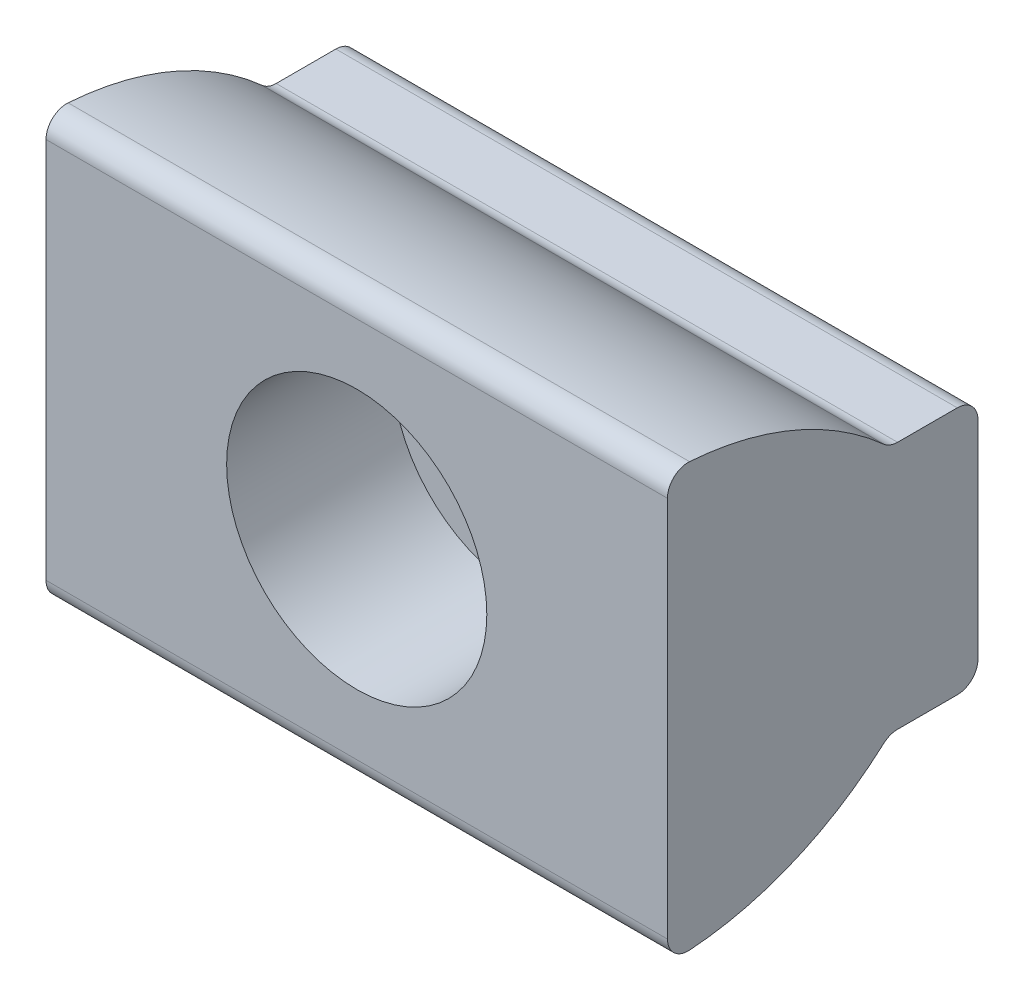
ISO-10303-21;
HEADER;
FILE_DESCRIPTION(('STEP AP214'),'2;1');
FILE_NAME('part.step','',(''),(''),'','','');
FILE_SCHEMA(('AUTOMOTIVE_DESIGN { 1 0 10303 214 1 1 1 1 }'));
ENDSEC;
DATA;
#1=APPLICATION_CONTEXT('core data for automotive mechanical design processes');
#2=APPLICATION_PROTOCOL_DEFINITION('international standard','automotive_design',2000,#1);
#3=PRODUCT_CONTEXT('',#1,'mechanical');
#4=PRODUCT('Part','Part','',(#3));
#5=PRODUCT_RELATED_PRODUCT_CATEGORY('part','',(#4));
#6=PRODUCT_DEFINITION_FORMATION('','',#4);
#7=PRODUCT_DEFINITION_CONTEXT('part definition',#1,'design');
#8=PRODUCT_DEFINITION('design','',#6,#7);
#9=PRODUCT_DEFINITION_SHAPE('','',#8);
#10=(LENGTH_UNIT() NAMED_UNIT(*) SI_UNIT(.MILLI.,.METRE.));
#11=(NAMED_UNIT(*) PLANE_ANGLE_UNIT() SI_UNIT($,.RADIAN.));
#12=(NAMED_UNIT(*) SI_UNIT($,.STERADIAN.) SOLID_ANGLE_UNIT());
#13=UNCERTAINTY_MEASURE_WITH_UNIT(LENGTH_MEASURE(1.E-05),#10,'distance_accuracy_value','');
#14=(GEOMETRIC_REPRESENTATION_CONTEXT(3) GLOBAL_UNCERTAINTY_ASSIGNED_CONTEXT((#13)) GLOBAL_UNIT_ASSIGNED_CONTEXT((#10,
#11,#12)) REPRESENTATION_CONTEXT('',''));
#15=CARTESIAN_POINT('',(0.,0.,0.));
#16=DIRECTION('',(0.,0.,1.));
#17=DIRECTION('',(1.,0.,0.));
#18=AXIS2_PLACEMENT_3D('',#15,#16,#17);
#19=CARTESIAN_POINT('',(23.8125,-7.9375,0.));
#20=DIRECTION('',(0.,0.,1.));
#21=DIRECTION('',(1.,0.,0.));
#22=AXIS2_PLACEMENT_3D('',#19,#20,#21);
#23=PLANE('',#22);
#24=DIRECTION('',(0.,1.,0.));
#25=VECTOR('',#24,1.);
#26=CARTESIAN_POINT('',(-23.8125,-7.9375,0.));
#27=LINE('',#26,#25);
#28=CARTESIAN_POINT('',(-23.8125,-7.9375,0.));
#29=VERTEX_POINT('',#28);
#30=CARTESIAN_POINT('',(-23.8125,7.9375,0.));
#31=VERTEX_POINT('',#30);
#32=EDGE_CURVE('E135',#29,#31,#27,.T.);
#33=ORIENTED_EDGE('',*,*,#32,.T.);
#34=DIRECTION('',(-1.,0.,0.));
#35=VECTOR('',#34,1.);
#36=CARTESIAN_POINT('',(23.8125,7.9375,0.));
#37=LINE('',#36,#35);
#38=CARTESIAN_POINT('',(23.8125,7.9375,0.));
#39=VERTEX_POINT('',#38);
#40=EDGE_CURVE('E186',#39,#31,#37,.T.);
#41=ORIENTED_EDGE('',*,*,#40,.F.);
#42=DIRECTION('',(0.,1.,0.));
#43=VECTOR('',#42,1.);
#44=CARTESIAN_POINT('',(23.8125,-7.9375,0.));
#45=LINE('',#44,#43);
#46=CARTESIAN_POINT('',(23.8125,-7.9375,0.));
#47=VERTEX_POINT('',#46);
#48=EDGE_CURVE('E158',#47,#39,#45,.T.);
#49=ORIENTED_EDGE('',*,*,#48,.F.);
#50=DIRECTION('',(-1.,0.,0.));
#51=VECTOR('',#50,1.);
#52=CARTESIAN_POINT('',(23.8125,-7.9375,0.));
#53=LINE('',#52,#51);
#54=EDGE_CURVE('E189',#47,#29,#53,.T.);
#55=ORIENTED_EDGE('',*,*,#54,.T.);
#56=EDGE_LOOP('',(#33,#41,#49,#55));
#57=FACE_BOUND('',#56,.T.);
#58=CARTESIAN_POINT('',(0.,0.,0.));
#59=DIRECTION('',(0.,0.,1.));
#60=DIRECTION('',(1.,0.,0.));
#61=AXIS2_PLACEMENT_3D('',#58,#59,#60);
#62=CIRCLE('',#61,6.7437);
#63=CARTESIAN_POINT('',(6.7437,0.,0.));
#64=VERTEX_POINT('',#63);
#65=EDGE_CURVE('E18',#64,#64,#62,.F.);
#66=ORIENTED_EDGE('',*,*,#65,.F.);
#67=EDGE_LOOP('',(#66));
#68=FACE_BOUND('',#67,.T.);
#69=ADVANCED_FACE('F14',(#57,#68),#23,.F.);
#70=CARTESIAN_POINT('',(23.8125,-14.6269565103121,23.7998));
#71=DIRECTION('',(0.,0.,-1.));
#72=DIRECTION('',(-1.,0.,0.));
#73=AXIS2_PLACEMENT_3D('',#70,#71,#72);
#74=PLANE('',#73);
#75=DIRECTION('',(0.,-1.,0.));
#76=VECTOR('',#75,1.);
#77=CARTESIAN_POINT('',(-23.8125,-14.6269565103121,23.7998));
#78=LINE('',#77,#76);
#79=CARTESIAN_POINT('',(-23.8125,14.6269565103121,23.7998));
#80=VERTEX_POINT('',#79);
#81=CARTESIAN_POINT('',(-23.8125,-14.6269565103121,23.7998));
#82=VERTEX_POINT('',#81);
#83=EDGE_CURVE('E147',#80,#82,#78,.T.);
#84=ORIENTED_EDGE('',*,*,#83,.T.);
#85=DIRECTION('',(-1.,0.,0.));
#86=VECTOR('',#85,1.);
#87=CARTESIAN_POINT('',(23.8125,-14.6269565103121,23.7998));
#88=LINE('',#87,#86);
#89=CARTESIAN_POINT('',(23.8125,-14.6269565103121,23.7998));
#90=VERTEX_POINT('',#89);
#91=EDGE_CURVE('E122',#90,#82,#88,.T.);
#92=ORIENTED_EDGE('',*,*,#91,.F.);
#93=DIRECTION('',(0.,-1.,0.));
#94=VECTOR('',#93,1.);
#95=CARTESIAN_POINT('',(23.8125,-14.6269565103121,23.7998));
#96=LINE('',#95,#94);
#97=CARTESIAN_POINT('',(23.8125,14.6269565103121,23.7998));
#98=VERTEX_POINT('',#97);
#99=EDGE_CURVE('E31',#98,#90,#96,.T.);
#100=ORIENTED_EDGE('',*,*,#99,.F.);
#101=DIRECTION('',(-1.,0.,0.));
#102=VECTOR('',#101,1.);
#103=CARTESIAN_POINT('',(23.8125,14.6269565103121,23.7998));
#104=LINE('',#103,#102);
#105=EDGE_CURVE('E171',#98,#80,#104,.T.);
#106=ORIENTED_EDGE('',*,*,#105,.T.);
#107=EDGE_LOOP('',(#84,#92,#100,#106));
#108=FACE_BOUND('',#107,.T.);
#109=CARTESIAN_POINT('',(0.,0.,23.7998));
#110=DIRECTION('',(0.,0.,-1.));
#111=DIRECTION('',(-1.,0.,0.));
#112=AXIS2_PLACEMENT_3D('',#109,#110,#111);
#113=CIRCLE('',#112,9.9695);
#114=CARTESIAN_POINT('',(-9.9695,0.,23.7998));
#115=VERTEX_POINT('',#114);
#116=EDGE_CURVE('E125',#115,#115,#113,.F.);
#117=ORIENTED_EDGE('',*,*,#116,.F.);
#118=EDGE_LOOP('',(#117));
#119=FACE_BOUND('',#118,.T.);
#120=ADVANCED_FACE('F224',(#108,#119),#74,.F.);
#121=CARTESIAN_POINT('',(23.8125,-14.6269565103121,22.2123));
#122=DIRECTION('',(-1.,0.,0.));
#123=DIRECTION('',(0.,-1.,0.));
#124=AXIS2_PLACEMENT_3D('',#121,#122,#123);
#125=CYLINDRICAL_SURFACE('',#124,1.5875);
#126=CARTESIAN_POINT('',(-23.8125,-14.6269565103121,22.2123));
#127=DIRECTION('',(1.,0.,0.));
#128=DIRECTION('',(0.,-1.,0.));
#129=AXIS2_PLACEMENT_3D('',#126,#127,#128);
#130=CIRCLE('',#129,1.5875);
#131=CARTESIAN_POINT('',(-23.8125,-16.21075392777,22.1039395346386));
#132=VERTEX_POINT('',#131);
#133=EDGE_CURVE('E109',#82,#132,#130,.T.);
#134=ORIENTED_EDGE('',*,*,#133,.T.);
#135=DIRECTION('',(-1.,0.,0.));
#136=VECTOR('',#135,1.);
#137=CARTESIAN_POINT('',(23.8125,-16.21075392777,22.1039395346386));
#138=LINE('',#137,#136);
#139=CARTESIAN_POINT('',(23.8125,-16.21075392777,22.1039395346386));
#140=VERTEX_POINT('',#139);
#141=EDGE_CURVE('E9',#140,#132,#138,.T.);
#142=ORIENTED_EDGE('',*,*,#141,.F.);
#143=CARTESIAN_POINT('',(23.8125,-14.6269565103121,22.2123));
#144=DIRECTION('',(1.,0.,0.));
#145=DIRECTION('',(0.,-1.,0.));
#146=AXIS2_PLACEMENT_3D('',#143,#144,#145);
#147=CIRCLE('',#146,1.5875);
#148=EDGE_CURVE('E149',#90,#140,#147,.T.);
#149=ORIENTED_EDGE('',*,*,#148,.F.);
#150=ORIENTED_EDGE('',*,*,#91,.T.);
#151=EDGE_LOOP('',(#134,#142,#149,#150));
#152=FACE_BOUND('',#151,.T.);
#153=ADVANCED_FACE('F16',(#152),#125,.T.);
#154=CARTESIAN_POINT('',(23.8125,8.57595602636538,23.7998));
#155=DIRECTION('',(-1.,0.,0.));
#156=DIRECTION('',(0.,-1.,0.));
#157=AXIS2_PLACEMENT_3D('',#154,#155,#156);
#158=CYLINDRICAL_SURFACE('',#157,24.8446560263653);
#159=CARTESIAN_POINT('',(-23.8125,8.57595602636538,23.7998));
#160=DIRECTION('',(1.,0.,0.));
#161=DIRECTION('',(0.,1.,0.));
#162=AXIS2_PLACEMENT_3D('',#159,#160,#161);
#163=CIRCLE('',#162,24.8446560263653);
#164=CARTESIAN_POINT('',(-23.8125,-9.93002272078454,7.22313918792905));
#165=VERTEX_POINT('',#164);
#166=EDGE_CURVE('E105',#132,#165,#163,.T.);
#167=ORIENTED_EDGE('',*,*,#166,.T.);
#168=DIRECTION('',(-1.,0.,0.));
#169=VECTOR('',#168,1.);
#170=CARTESIAN_POINT('',(23.8125,-9.93002272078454,7.22313918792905));
#171=LINE('',#170,#169);
#172=CARTESIAN_POINT('',(23.8125,-9.93002272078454,7.22313918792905));
#173=VERTEX_POINT('',#172);
#174=EDGE_CURVE('E23',#173,#165,#171,.T.);
#175=ORIENTED_EDGE('',*,*,#174,.F.);
#176=CARTESIAN_POINT('',(23.8125,8.57595602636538,23.7998));
#177=DIRECTION('',(1.,0.,0.));
#178=DIRECTION('',(0.,1.,0.));
#179=AXIS2_PLACEMENT_3D('',#176,#177,#178);
#180=CIRCLE('',#179,24.8446560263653);
#181=EDGE_CURVE('E118',#140,#173,#180,.T.);
#182=ORIENTED_EDGE('',*,*,#181,.F.);
#183=ORIENTED_EDGE('',*,*,#141,.T.);
#184=EDGE_LOOP('',(#167,#175,#182,#183));
#185=FACE_BOUND('',#184,.T.);
#186=ADVANCED_FACE('F117',(#185),#158,.T.);
#187=CARTESIAN_POINT('',(23.8125,-11.1125,6.16393961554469));
#188=DIRECTION('',(-1.,0.,0.));
#189=DIRECTION('',(0.,-1.,0.));
#190=AXIS2_PLACEMENT_3D('',#187,#188,#189);
#191=CYLINDRICAL_SURFACE('',#190,1.5875);
#192=CARTESIAN_POINT('',(-23.8125,-11.1125,6.16393961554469));
#193=DIRECTION('',(-1.,0.,0.));
#194=DIRECTION('',(0.,-1.,0.));
#195=AXIS2_PLACEMENT_3D('',#192,#193,#194);
#196=CIRCLE('',#195,1.5875);
#197=CARTESIAN_POINT('',(-23.8125,-9.525,6.16393961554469));
#198=VERTEX_POINT('',#197);
#199=EDGE_CURVE('E111',#165,#198,#196,.T.);
#200=ORIENTED_EDGE('',*,*,#199,.T.);
#201=DIRECTION('',(-1.,0.,0.));
#202=VECTOR('',#201,1.);
#203=CARTESIAN_POINT('',(23.8125,-9.525,6.16393961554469));
#204=LINE('',#203,#202);
#205=CARTESIAN_POINT('',(23.8125,-9.525,6.16393961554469));
#206=VERTEX_POINT('',#205);
#207=EDGE_CURVE('E195',#206,#198,#204,.T.);
#208=ORIENTED_EDGE('',*,*,#207,.F.);
#209=CARTESIAN_POINT('',(23.8125,-11.1125,6.16393961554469));
#210=DIRECTION('',(-1.,0.,0.));
#211=DIRECTION('',(0.,-1.,0.));
#212=AXIS2_PLACEMENT_3D('',#209,#210,#211);
#213=CIRCLE('',#212,1.5875);
#214=EDGE_CURVE('E152',#173,#206,#213,.T.);
#215=ORIENTED_EDGE('',*,*,#214,.F.);
#216=ORIENTED_EDGE('',*,*,#174,.T.);
#217=EDGE_LOOP('',(#200,#208,#215,#216));
#218=FACE_BOUND('',#217,.T.);
#219=ADVANCED_FACE('F245',(#218),#191,.F.);
#220=CARTESIAN_POINT('',(23.8125,-9.525,1.5875));
#221=DIRECTION('',(0.,1.,0.));
#222=DIRECTION('',(-1.,0.,0.));
#223=AXIS2_PLACEMENT_3D('',#220,#221,#222);
#224=PLANE('',#223);
#225=DIRECTION('',(0.,0.,-1.));
#226=VECTOR('',#225,1.);
#227=CARTESIAN_POINT('',(-23.8125,-9.525,1.5875));
#228=LINE('',#227,#226);
#229=CARTESIAN_POINT('',(-23.8125,-9.525,1.5875));
#230=VERTEX_POINT('',#229);
#231=EDGE_CURVE('E131',#198,#230,#228,.T.);
#232=ORIENTED_EDGE('',*,*,#231,.T.);
#233=DIRECTION('',(-1.,0.,0.));
#234=VECTOR('',#233,1.);
#235=CARTESIAN_POINT('',(23.8125,-9.525,1.5875));
#236=LINE('',#235,#234);
#237=CARTESIAN_POINT('',(23.8125,-9.525,1.5875));
#238=VERTEX_POINT('',#237);
#239=EDGE_CURVE('E192',#238,#230,#236,.T.);
#240=ORIENTED_EDGE('',*,*,#239,.F.);
#241=DIRECTION('',(0.,0.,-1.));
#242=VECTOR('',#241,1.);
#243=CARTESIAN_POINT('',(23.8125,-9.525,1.5875));
#244=LINE('',#243,#242);
#245=EDGE_CURVE('E154',#206,#238,#244,.T.);
#246=ORIENTED_EDGE('',*,*,#245,.F.);
#247=ORIENTED_EDGE('',*,*,#207,.T.);
#248=EDGE_LOOP('',(#232,#240,#246,#247));
#249=FACE_BOUND('',#248,.T.);
#250=ADVANCED_FACE('F241',(#249),#224,.F.);
#251=CARTESIAN_POINT('',(23.8125,-7.9375,1.5875));
#252=DIRECTION('',(-1.,0.,0.));
#253=DIRECTION('',(0.,-1.,0.));
#254=AXIS2_PLACEMENT_3D('',#251,#252,#253);
#255=CYLINDRICAL_SURFACE('',#254,1.5875);
#256=CARTESIAN_POINT('',(-23.8125,-7.9375,1.5875));
#257=DIRECTION('',(1.,0.,0.));
#258=DIRECTION('',(0.,1.,0.));
#259=AXIS2_PLACEMENT_3D('',#256,#257,#258);
#260=CIRCLE('',#259,1.5875);
#261=EDGE_CURVE('E133',#230,#29,#260,.T.);
#262=ORIENTED_EDGE('',*,*,#261,.T.);
#263=ORIENTED_EDGE('',*,*,#54,.F.);
#264=CARTESIAN_POINT('',(23.8125,-7.9375,1.5875));
#265=DIRECTION('',(1.,0.,0.));
#266=DIRECTION('',(0.,1.,0.));
#267=AXIS2_PLACEMENT_3D('',#264,#265,#266);
#268=CIRCLE('',#267,1.5875);
#269=EDGE_CURVE('E156',#238,#47,#268,.T.);
#270=ORIENTED_EDGE('',*,*,#269,.F.);
#271=ORIENTED_EDGE('',*,*,#239,.T.);
#272=EDGE_LOOP('',(#262,#263,#270,#271));
#273=FACE_BOUND('',#272,.T.);
#274=ADVANCED_FACE('F238',(#273),#255,.T.);
#275=CARTESIAN_POINT('',(23.8125,7.9375,1.5875));
#276=DIRECTION('',(-1.,0.,0.));
#277=DIRECTION('',(0.,-1.,0.));
#278=AXIS2_PLACEMENT_3D('',#275,#276,#277);
#279=CYLINDRICAL_SURFACE('',#278,1.5875);
#280=CARTESIAN_POINT('',(-23.8125,7.9375,1.5875));
#281=DIRECTION('',(1.,0.,0.));
#282=DIRECTION('',(0.,1.,0.));
#283=AXIS2_PLACEMENT_3D('',#280,#281,#282);
#284=CIRCLE('',#283,1.5875);
#285=CARTESIAN_POINT('',(-23.8125,9.525,1.5875));
#286=VERTEX_POINT('',#285);
#287=EDGE_CURVE('E137',#31,#286,#284,.T.);
#288=ORIENTED_EDGE('',*,*,#287,.T.);
#289=DIRECTION('',(-1.,0.,0.));
#290=VECTOR('',#289,1.);
#291=CARTESIAN_POINT('',(23.8125,9.525,1.5875));
#292=LINE('',#291,#290);
#293=CARTESIAN_POINT('',(23.8125,9.525,1.5875));
#294=VERTEX_POINT('',#293);
#295=EDGE_CURVE('E183',#294,#286,#292,.T.);
#296=ORIENTED_EDGE('',*,*,#295,.F.);
#297=CARTESIAN_POINT('',(23.8125,7.9375,1.5875));
#298=DIRECTION('',(1.,0.,0.));
#299=DIRECTION('',(0.,1.,0.));
#300=AXIS2_PLACEMENT_3D('',#297,#298,#299);
#301=CIRCLE('',#300,1.5875);
#302=EDGE_CURVE('E160',#39,#294,#301,.T.);
#303=ORIENTED_EDGE('',*,*,#302,.F.);
#304=ORIENTED_EDGE('',*,*,#40,.T.);
#305=EDGE_LOOP('',(#288,#296,#303,#304));
#306=FACE_BOUND('',#305,.T.);
#307=ADVANCED_FACE('F236',(#306),#279,.T.);
#308=CARTESIAN_POINT('',(23.8125,9.525,1.5875));
#309=DIRECTION('',(0.,-1.,0.));
#310=DIRECTION('',(1.,0.,0.));
#311=AXIS2_PLACEMENT_3D('',#308,#309,#310);
#312=PLANE('',#311);
#313=DIRECTION('',(0.,0.,1.));
#314=VECTOR('',#313,1.);
#315=CARTESIAN_POINT('',(-23.8125,9.525,1.5875));
#316=LINE('',#315,#314);
#317=CARTESIAN_POINT('',(-23.8125,9.525,6.16393961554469));
#318=VERTEX_POINT('',#317);
#319=EDGE_CURVE('E139',#286,#318,#316,.T.);
#320=ORIENTED_EDGE('',*,*,#319,.T.);
#321=DIRECTION('',(-1.,0.,0.));
#322=VECTOR('',#321,1.);
#323=CARTESIAN_POINT('',(23.8125,9.525,6.16393961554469));
#324=LINE('',#323,#322);
#325=CARTESIAN_POINT('',(23.8125,9.525,6.16393961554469));
#326=VERTEX_POINT('',#325);
#327=EDGE_CURVE('E180',#326,#318,#324,.T.);
#328=ORIENTED_EDGE('',*,*,#327,.F.);
#329=DIRECTION('',(0.,0.,1.));
#330=VECTOR('',#329,1.);
#331=CARTESIAN_POINT('',(23.8125,9.525,1.5875));
#332=LINE('',#331,#330);
#333=EDGE_CURVE('E162',#294,#326,#332,.T.);
#334=ORIENTED_EDGE('',*,*,#333,.F.);
#335=ORIENTED_EDGE('',*,*,#295,.T.);
#336=EDGE_LOOP('',(#320,#328,#334,#335));
#337=FACE_BOUND('',#336,.T.);
#338=ADVANCED_FACE('F303',(#337),#312,.F.);
#339=CARTESIAN_POINT('',(23.8125,11.1125,6.16393961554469));
#340=DIRECTION('',(-1.,0.,0.));
#341=DIRECTION('',(0.,-1.,0.));
#342=AXIS2_PLACEMENT_3D('',#339,#340,#341);
#343=CYLINDRICAL_SURFACE('',#342,1.5875);
#344=CARTESIAN_POINT('',(-23.8125,11.1125,6.16393961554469));
#345=DIRECTION('',(-1.,0.,0.));
#346=DIRECTION('',(0.,-1.,0.));
#347=AXIS2_PLACEMENT_3D('',#344,#345,#346);
#348=CIRCLE('',#347,1.5875);
#349=CARTESIAN_POINT('',(-23.8125,9.93002272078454,7.22313918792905));
#350=VERTEX_POINT('',#349);
#351=EDGE_CURVE('E141',#318,#350,#348,.T.);
#352=ORIENTED_EDGE('',*,*,#351,.T.);
#353=DIRECTION('',(-1.,0.,0.));
#354=VECTOR('',#353,1.);
#355=CARTESIAN_POINT('',(23.8125,9.93002272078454,7.22313918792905));
#356=LINE('',#355,#354);
#357=CARTESIAN_POINT('',(23.8125,9.93002272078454,7.22313918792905));
#358=VERTEX_POINT('',#357);
#359=EDGE_CURVE('E177',#358,#350,#356,.T.);
#360=ORIENTED_EDGE('',*,*,#359,.F.);
#361=CARTESIAN_POINT('',(23.8125,11.1125,6.16393961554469));
#362=DIRECTION('',(-1.,0.,0.));
#363=DIRECTION('',(0.,-1.,0.));
#364=AXIS2_PLACEMENT_3D('',#361,#362,#363);
#365=CIRCLE('',#364,1.5875);
#366=EDGE_CURVE('E164',#326,#358,#365,.T.);
#367=ORIENTED_EDGE('',*,*,#366,.F.);
#368=ORIENTED_EDGE('',*,*,#327,.T.);
#369=EDGE_LOOP('',(#352,#360,#367,#368));
#370=FACE_BOUND('',#369,.T.);
#371=ADVANCED_FACE('F310',(#370),#343,.F.);
#372=CARTESIAN_POINT('',(23.8125,-8.57595602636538,23.7998));
#373=DIRECTION('',(-1.,0.,0.));
#374=DIRECTION('',(0.,-1.,0.));
#375=AXIS2_PLACEMENT_3D('',#372,#373,#374);
#376=CYLINDRICAL_SURFACE('',#375,24.8446560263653);
#377=CARTESIAN_POINT('',(-23.8125,-8.57595602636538,23.7998));
#378=DIRECTION('',(1.,0.,0.));
#379=DIRECTION('',(0.,-1.,0.));
#380=AXIS2_PLACEMENT_3D('',#377,#378,#379);
#381=CIRCLE('',#380,24.8446560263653);
#382=CARTESIAN_POINT('',(-23.8125,16.21075392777,22.1039395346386));
#383=VERTEX_POINT('',#382);
#384=EDGE_CURVE('E143',#350,#383,#381,.T.);
#385=ORIENTED_EDGE('',*,*,#384,.T.);
#386=DIRECTION('',(-1.,0.,0.));
#387=VECTOR('',#386,1.);
#388=CARTESIAN_POINT('',(23.8125,16.21075392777,22.1039395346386));
#389=LINE('',#388,#387);
#390=CARTESIAN_POINT('',(23.8125,16.21075392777,22.1039395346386));
#391=VERTEX_POINT('',#390);
#392=EDGE_CURVE('E174',#391,#383,#389,.T.);
#393=ORIENTED_EDGE('',*,*,#392,.F.);
#394=CARTESIAN_POINT('',(23.8125,-8.57595602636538,23.7998));
#395=DIRECTION('',(1.,0.,0.));
#396=DIRECTION('',(0.,-1.,0.));
#397=AXIS2_PLACEMENT_3D('',#394,#395,#396);
#398=CIRCLE('',#397,24.8446560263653);
#399=EDGE_CURVE('E166',#358,#391,#398,.T.);
#400=ORIENTED_EDGE('',*,*,#399,.F.);
#401=ORIENTED_EDGE('',*,*,#359,.T.);
#402=EDGE_LOOP('',(#385,#393,#400,#401));
#403=FACE_BOUND('',#402,.T.);
#404=ADVANCED_FACE('F318',(#403),#376,.T.);
#405=CARTESIAN_POINT('',(23.8125,14.6269565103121,22.2123));
#406=DIRECTION('',(-1.,0.,0.));
#407=DIRECTION('',(0.,-1.,0.));
#408=AXIS2_PLACEMENT_3D('',#405,#406,#407);
#409=CYLINDRICAL_SURFACE('',#408,1.5875);
#410=CARTESIAN_POINT('',(-23.8125,14.6269565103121,22.2123));
#411=DIRECTION('',(1.,0.,0.));
#412=DIRECTION('',(0.,-1.,0.));
#413=AXIS2_PLACEMENT_3D('',#410,#411,#412);
#414=CIRCLE('',#413,1.5875);
#415=EDGE_CURVE('E145',#383,#80,#414,.T.);
#416=ORIENTED_EDGE('',*,*,#415,.T.);
#417=ORIENTED_EDGE('',*,*,#105,.F.);
#418=CARTESIAN_POINT('',(23.8125,14.6269565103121,22.2123));
#419=DIRECTION('',(1.,0.,0.));
#420=DIRECTION('',(0.,-1.,0.));
#421=AXIS2_PLACEMENT_3D('',#418,#419,#420);
#422=CIRCLE('',#421,1.5875);
#423=EDGE_CURVE('E36',#391,#98,#422,.T.);
#424=ORIENTED_EDGE('',*,*,#423,.F.);
#425=ORIENTED_EDGE('',*,*,#392,.T.);
#426=EDGE_LOOP('',(#416,#417,#424,#425));
#427=FACE_BOUND('',#426,.T.);
#428=ADVANCED_FACE('F327',(#427),#409,.T.);
#429=CARTESIAN_POINT('',(23.8125,-14.6269565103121,22.2123));
#430=DIRECTION('',(-1.,0.,0.));
#431=DIRECTION('',(0.,-1.,0.));
#432=AXIS2_PLACEMENT_3D('',#429,#430,#431);
#433=PLANE('',#432);
#434=ORIENTED_EDGE('',*,*,#148,.T.);
#435=ORIENTED_EDGE('',*,*,#181,.T.);
#436=ORIENTED_EDGE('',*,*,#214,.T.);
#437=ORIENTED_EDGE('',*,*,#245,.T.);
#438=ORIENTED_EDGE('',*,*,#269,.T.);
#439=ORIENTED_EDGE('',*,*,#48,.T.);
#440=ORIENTED_EDGE('',*,*,#302,.T.);
#441=ORIENTED_EDGE('',*,*,#333,.T.);
#442=ORIENTED_EDGE('',*,*,#366,.T.);
#443=ORIENTED_EDGE('',*,*,#399,.T.);
#444=ORIENTED_EDGE('',*,*,#423,.T.);
#445=ORIENTED_EDGE('',*,*,#99,.T.);
#446=EDGE_LOOP('',(#434,#435,#436,#437,#438,#439,#440,#441,#442,#443,#444,#445));
#447=FACE_BOUND('',#446,.T.);
#448=ADVANCED_FACE('F336',(#447),#433,.F.);
#449=CARTESIAN_POINT('',(-23.8125,-14.6269565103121,22.2123));
#450=DIRECTION('',(-1.,0.,0.));
#451=DIRECTION('',(0.,-1.,0.));
#452=AXIS2_PLACEMENT_3D('',#449,#450,#451);
#453=PLANE('',#452);
#454=ORIENTED_EDGE('',*,*,#133,.F.);
#455=ORIENTED_EDGE('',*,*,#83,.F.);
#456=ORIENTED_EDGE('',*,*,#415,.F.);
#457=ORIENTED_EDGE('',*,*,#384,.F.);
#458=ORIENTED_EDGE('',*,*,#351,.F.);
#459=ORIENTED_EDGE('',*,*,#319,.F.);
#460=ORIENTED_EDGE('',*,*,#287,.F.);
#461=ORIENTED_EDGE('',*,*,#32,.F.);
#462=ORIENTED_EDGE('',*,*,#261,.F.);
#463=ORIENTED_EDGE('',*,*,#231,.F.);
#464=ORIENTED_EDGE('',*,*,#199,.F.);
#465=ORIENTED_EDGE('',*,*,#166,.F.);
#466=EDGE_LOOP('',(#454,#455,#456,#457,#458,#459,#460,#461,#462,#463,#464,#465));
#467=FACE_BOUND('',#466,.T.);
#468=ADVANCED_FACE('F106',(#467),#453,.T.);
#469=CARTESIAN_POINT('',(0.,0.,25.2235199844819));
#470=DIRECTION('',(0.,0.,1.));
#471=DIRECTION('',(1.,0.,0.));
#472=AXIS2_PLACEMENT_3D('',#469,#470,#471);
#473=CYLINDRICAL_SURFACE('',#472,6.7437);
#474=CARTESIAN_POINT('',(0.,0.,11.0998));
#475=DIRECTION('',(0.,0.,1.));
#476=DIRECTION('',(1.,0.,0.));
#477=AXIS2_PLACEMENT_3D('',#474,#475,#476);
#478=CIRCLE('',#477,6.7437);
#479=CARTESIAN_POINT('',(6.7437,0.,11.0998));
#480=VERTEX_POINT('',#479);
#481=EDGE_CURVE('E127',#480,#480,#478,.T.);
#482=ORIENTED_EDGE('',*,*,#481,.T.);
#483=EDGE_LOOP('',(#482));
#484=FACE_BOUND('',#483,.T.);
#485=ORIENTED_EDGE('',*,*,#65,.T.);
#486=EDGE_LOOP('',(#485));
#487=FACE_BOUND('',#486,.T.);
#488=ADVANCED_FACE('F213',(#484,#487),#473,.F.);
#489=CARTESIAN_POINT('',(0.,0.,25.2235199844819));
#490=DIRECTION('',(0.,0.,1.));
#491=DIRECTION('',(1.,0.,0.));
#492=AXIS2_PLACEMENT_3D('',#489,#490,#491);
#493=CYLINDRICAL_SURFACE('',#492,9.9695);
#494=CARTESIAN_POINT('',(0.,0.,11.0998));
#495=DIRECTION('',(0.,0.,1.));
#496=DIRECTION('',(1.,0.,0.));
#497=AXIS2_PLACEMENT_3D('',#494,#495,#496);
#498=CIRCLE('',#497,9.9695);
#499=CARTESIAN_POINT('',(9.9695,0.,11.0998));
#500=VERTEX_POINT('',#499);
#501=EDGE_CURVE('E202',#500,#500,#498,.T.);
#502=ORIENTED_EDGE('',*,*,#501,.F.);
#503=EDGE_LOOP('',(#502));
#504=FACE_BOUND('',#503,.T.);
#505=ORIENTED_EDGE('',*,*,#116,.T.);
#506=EDGE_LOOP('',(#505));
#507=FACE_BOUND('',#506,.T.);
#508=ADVANCED_FACE('F211',(#504,#507),#493,.F.);
#509=CARTESIAN_POINT('',(0.,6.7437,11.0998));
#510=DIRECTION('',(0.,0.,1.));
#511=DIRECTION('',(1.,0.,0.));
#512=AXIS2_PLACEMENT_3D('',#509,#510,#511);
#513=PLANE('',#512);
#514=ORIENTED_EDGE('',*,*,#501,.T.);
#515=EDGE_LOOP('',(#514));
#516=FACE_BOUND('',#515,.T.);
#517=ORIENTED_EDGE('',*,*,#481,.F.);
#518=EDGE_LOOP('',(#517));
#519=FACE_BOUND('',#518,.T.);
#520=ADVANCED_FACE('F208',(#516,#519),#513,.T.);
#521=CLOSED_SHELL('',(#69,#120,#153,#186,#219,#250,#274,#307,#338,#371,#404,#428,#448,#468,#488,
#508,#520));
#522=MANIFOLD_SOLID_BREP('B1',#521);
#523=ADVANCED_BREP_SHAPE_REPRESENTATION('',(#18,#522),#14);
#524=SHAPE_DEFINITION_REPRESENTATION(#9,#523);
ENDSEC;
END-ISO-10303-21;
